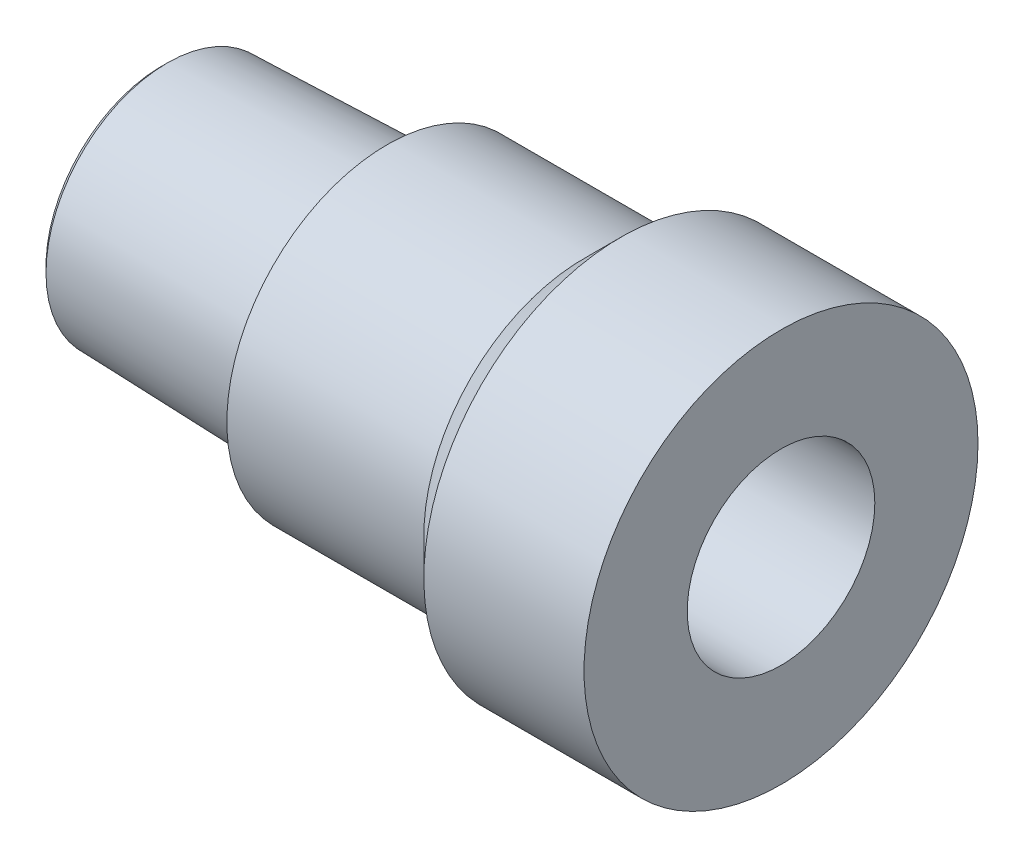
ISO-10303-21;
HEADER;
FILE_DESCRIPTION(('STEP AP214'),'2;1');
FILE_NAME('part.step','',(''),(''),'','','');
FILE_SCHEMA(('AUTOMOTIVE_DESIGN { 1 0 10303 214 1 1 1 1 }'));
ENDSEC;
DATA;
#1=APPLICATION_CONTEXT('core data for automotive mechanical design processes');
#2=APPLICATION_PROTOCOL_DEFINITION('international standard','automotive_design',2000,#1);
#3=PRODUCT_CONTEXT('',#1,'mechanical');
#4=PRODUCT('Part','Part','',(#3));
#5=PRODUCT_RELATED_PRODUCT_CATEGORY('part','',(#4));
#6=PRODUCT_DEFINITION_FORMATION('','',#4);
#7=PRODUCT_DEFINITION_CONTEXT('part definition',#1,'design');
#8=PRODUCT_DEFINITION('design','',#6,#7);
#9=PRODUCT_DEFINITION_SHAPE('','',#8);
#10=(LENGTH_UNIT() NAMED_UNIT(*) SI_UNIT(.MILLI.,.METRE.));
#11=(NAMED_UNIT(*) PLANE_ANGLE_UNIT() SI_UNIT($,.RADIAN.));
#12=(NAMED_UNIT(*) SI_UNIT($,.STERADIAN.) SOLID_ANGLE_UNIT());
#13=UNCERTAINTY_MEASURE_WITH_UNIT(LENGTH_MEASURE(1.E-05),#10,'distance_accuracy_value','');
#14=(GEOMETRIC_REPRESENTATION_CONTEXT(3) GLOBAL_UNCERTAINTY_ASSIGNED_CONTEXT((#13)) GLOBAL_UNIT_ASSIGNED_CONTEXT((#10,
#11,#12)) REPRESENTATION_CONTEXT('',''));
#15=CARTESIAN_POINT('',(0.,0.,0.));
#16=DIRECTION('',(0.,0.,1.));
#17=DIRECTION('',(1.,0.,0.));
#18=AXIS2_PLACEMENT_3D('',#15,#16,#17);
#19=CARTESIAN_POINT('',(93.,52.711266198,120.988));
#20=DIRECTION('',(1.,0.,0.));
#21=DIRECTION('',(0.,0.866025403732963,-0.500000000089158));
#22=AXIS2_PLACEMENT_3D('',#19,#20,#21);
#23=PLANE('',#22);
#24=DIRECTION('',(0.,0.500000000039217,0.866025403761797));
#25=VECTOR('',#24,1.);
#26=CARTESIAN_POINT('',(93.,54.4641016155,120.));
#27=LINE('',#26,#25);
#28=CARTESIAN_POINT('',(93.,54.4641016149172,119.999999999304));
#29=VERTEX_POINT('',#28);
#30=CARTESIAN_POINT('',(93.,55.6188021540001,122.));
#31=VERTEX_POINT('',#30);
#32=EDGE_CURVE('E146',#29,#31,#27,.T.);
#33=ORIENTED_EDGE('',*,*,#32,.T.);
#34=DIRECTION('',(0.,-0.500000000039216,0.866025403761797));
#35=VECTOR('',#34,1.);
#36=CARTESIAN_POINT('',(93.,54.4641016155,124.));
#37=LINE('',#36,#35);
#38=CARTESIAN_POINT('',(93.,54.464101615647,123.999999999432));
#39=VERTEX_POINT('',#38);
#40=EDGE_CURVE('E128',#31,#39,#37,.T.);
#41=ORIENTED_EDGE('',*,*,#40,.T.);
#42=CARTESIAN_POINT('',(93.,51.,122.));
#43=DIRECTION('',(-1.,0.,0.));
#44=DIRECTION('',(0.,0.,1.));
#45=AXIS2_PLACEMENT_3D('',#42,#43,#44);
#46=CIRCLE('',#45,4.);
#47=EDGE_CURVE('E88',#29,#39,#46,.F.);
#48=ORIENTED_EDGE('',*,*,#47,.F.);
#49=EDGE_LOOP('',(#33,#41,#48));
#50=FACE_BOUND('',#49,.T.);
#51=ADVANCED_FACE('F16',(#50),#23,.T.);
#52=CARTESIAN_POINT('',(93.,50.975751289,126.006));
#53=DIRECTION('',(1.,0.,0.));
#54=DIRECTION('',(0.,0.866025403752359,-0.500000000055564));
#55=AXIS2_PLACEMENT_3D('',#52,#53,#54);
#56=PLANE('',#55);
#57=DIRECTION('',(0.,-0.500000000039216,0.866025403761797));
#58=VECTOR('',#57,1.);
#59=CARTESIAN_POINT('',(93.,54.4641016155,124.));
#60=LINE('',#59,#58);
#61=CARTESIAN_POINT('',(93.,53.3094010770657,126.));
#62=VERTEX_POINT('',#61);
#63=EDGE_CURVE('E137',#39,#62,#60,.T.);
#64=ORIENTED_EDGE('',*,*,#63,.T.);
#65=DIRECTION('',(0.,-1.,0.));
#66=VECTOR('',#65,1.);
#67=CARTESIAN_POINT('',(93.,51.,126.));
#68=LINE('',#67,#66);
#69=CARTESIAN_POINT('',(93.,50.9999999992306,126.));
#70=VERTEX_POINT('',#69);
#71=EDGE_CURVE('E119',#62,#70,#68,.T.);
#72=ORIENTED_EDGE('',*,*,#71,.T.);
#73=CARTESIAN_POINT('',(93.,51.,122.));
#74=DIRECTION('',(-1.,0.,0.));
#75=DIRECTION('',(0.,0.,1.));
#76=AXIS2_PLACEMENT_3D('',#73,#74,#75);
#77=CIRCLE('',#76,4.);
#78=EDGE_CURVE('E178',#39,#70,#77,.F.);
#79=ORIENTED_EDGE('',*,*,#78,.F.);
#80=EDGE_LOOP('',(#64,#72,#79));
#81=FACE_BOUND('',#80,.T.);
#82=ADVANCED_FACE('F250',(#81),#56,.T.);
#83=CARTESIAN_POINT('',(93.,47.52550608,123.982));
#84=DIRECTION('',(1.,0.,0.));
#85=DIRECTION('',(0.,0.866025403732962,-0.50000000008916));
#86=AXIS2_PLACEMENT_3D('',#83,#84,#85);
#87=PLANE('',#86);
#88=DIRECTION('',(0.,-1.,0.));
#89=VECTOR('',#88,1.);
#90=CARTESIAN_POINT('',(93.,51.,126.));
#91=LINE('',#90,#89);
#92=CARTESIAN_POINT('',(93.,48.6905989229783,125.999999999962));
#93=VERTEX_POINT('',#92);
#94=EDGE_CURVE('E124',#70,#93,#91,.T.);
#95=ORIENTED_EDGE('',*,*,#94,.T.);
#96=DIRECTION('',(0.,-0.500000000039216,-0.866025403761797));
#97=VECTOR('',#96,1.);
#98=CARTESIAN_POINT('',(93.,47.5358983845,124.));
#99=LINE('',#98,#97);
#100=CARTESIAN_POINT('',(93.,47.5358983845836,123.999999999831));
#101=VERTEX_POINT('',#100);
#102=EDGE_CURVE('E104',#93,#101,#99,.T.);
#103=ORIENTED_EDGE('',*,*,#102,.T.);
#104=CARTESIAN_POINT('',(93.,51.,122.));
#105=DIRECTION('',(-1.,0.,0.));
#106=DIRECTION('',(0.,0.,1.));
#107=AXIS2_PLACEMENT_3D('',#104,#105,#106);
#108=CIRCLE('',#107,4.);
#109=EDGE_CURVE('E83',#70,#101,#108,.F.);
#110=ORIENTED_EDGE('',*,*,#109,.F.);
#111=EDGE_LOOP('',(#95,#103,#110));
#112=FACE_BOUND('',#111,.T.);
#113=ADVANCED_FACE('F253',(#112),#87,.T.);
#114=CARTESIAN_POINT('',(93.,47.542826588,124.024));
#115=DIRECTION('',(1.,0.,0.));
#116=DIRECTION('',(0.,-1.,0.));
#117=AXIS2_PLACEMENT_3D('',#114,#115,#116);
#118=PLANE('',#117);
#119=DIRECTION('',(0.,-0.500000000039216,-0.866025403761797));
#120=VECTOR('',#119,1.);
#121=CARTESIAN_POINT('',(93.,47.5358983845,124.));
#122=LINE('',#121,#120);
#123=CARTESIAN_POINT('',(93.,46.3811978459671,122.000000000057));
#124=VERTEX_POINT('',#123);
#125=EDGE_CURVE('E107',#101,#124,#122,.T.);
#126=ORIENTED_EDGE('',*,*,#125,.T.);
#127=DIRECTION('',(0.,0.500000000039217,-0.866025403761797));
#128=VECTOR('',#127,1.);
#129=CARTESIAN_POINT('',(93.,47.5358983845,120.));
#130=LINE('',#129,#128);
#131=CARTESIAN_POINT('',(93.,47.5358983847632,119.999999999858));
#132=VERTEX_POINT('',#131);
#133=EDGE_CURVE('E101',#124,#132,#130,.T.);
#134=ORIENTED_EDGE('',*,*,#133,.T.);
#135=CARTESIAN_POINT('',(93.,51.,122.));
#136=DIRECTION('',(-1.,0.,0.));
#137=DIRECTION('',(0.,0.,1.));
#138=AXIS2_PLACEMENT_3D('',#135,#136,#137);
#139=CIRCLE('',#138,4.);
#140=EDGE_CURVE('E79',#101,#132,#139,.F.);
#141=ORIENTED_EDGE('',*,*,#140,.F.);
#142=EDGE_LOOP('',(#126,#134,#141));
#143=FACE_BOUND('',#142,.T.);
#144=ADVANCED_FACE('F106',(#143),#118,.T.);
#145=CARTESIAN_POINT('',(93.,50.97921539,117.988));
#146=DIRECTION('',(1.,0.,0.));
#147=DIRECTION('',(0.,0.866025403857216,-0.499999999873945));
#148=AXIS2_PLACEMENT_3D('',#145,#146,#147);
#149=PLANE('',#148);
#150=DIRECTION('',(0.,1.,0.));
#151=VECTOR('',#150,1.);
#152=CARTESIAN_POINT('',(93.,51.,118.));
#153=LINE('',#152,#151);
#154=CARTESIAN_POINT('',(93.,50.9999999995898,118.));
#155=VERTEX_POINT('',#154);
#156=CARTESIAN_POINT('',(93.,53.3094010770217,118.000000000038));
#157=VERTEX_POINT('',#156);
#158=EDGE_CURVE('E109',#155,#157,#153,.T.);
#159=ORIENTED_EDGE('',*,*,#158,.T.);
#160=DIRECTION('',(0.,0.500000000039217,0.866025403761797));
#161=VECTOR('',#160,1.);
#162=CARTESIAN_POINT('',(93.,54.4641016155,120.));
#163=LINE('',#162,#161);
#164=EDGE_CURVE('E141',#157,#29,#163,.T.);
#165=ORIENTED_EDGE('',*,*,#164,.T.);
#166=CARTESIAN_POINT('',(93.,51.,122.));
#167=DIRECTION('',(-1.,0.,0.));
#168=DIRECTION('',(0.,0.,1.));
#169=AXIS2_PLACEMENT_3D('',#166,#167,#168);
#170=CIRCLE('',#169,4.);
#171=EDGE_CURVE('E73',#155,#29,#170,.F.);
#172=ORIENTED_EDGE('',*,*,#171,.F.);
#173=EDGE_LOOP('',(#159,#165,#172));
#174=FACE_BOUND('',#173,.T.);
#175=ADVANCED_FACE('F190',(#174),#149,.T.);
#176=CARTESIAN_POINT('',(93.,51.02078461,120.012));
#177=DIRECTION('',(1.,0.,0.));
#178=DIRECTION('',(0.,-1.,0.));
#179=AXIS2_PLACEMENT_3D('',#176,#177,#178);
#180=PLANE('',#179);
#181=DIRECTION('',(0.,0.500000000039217,-0.866025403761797));
#182=VECTOR('',#181,1.);
#183=CARTESIAN_POINT('',(93.,47.5358983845,120.));
#184=LINE('',#183,#182);
#185=CARTESIAN_POINT('',(93.,48.6905989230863,118.));
#186=VERTEX_POINT('',#185);
#187=EDGE_CURVE('E95',#132,#186,#184,.T.);
#188=ORIENTED_EDGE('',*,*,#187,.T.);
#189=DIRECTION('',(0.,1.,0.));
#190=VECTOR('',#189,1.);
#191=CARTESIAN_POINT('',(93.,51.,118.));
#192=LINE('',#191,#190);
#193=EDGE_CURVE('E97',#186,#155,#192,.T.);
#194=ORIENTED_EDGE('',*,*,#193,.T.);
#195=CARTESIAN_POINT('',(93.,51.,122.));
#196=DIRECTION('',(-1.,0.,0.));
#197=DIRECTION('',(0.,0.,1.));
#198=AXIS2_PLACEMENT_3D('',#195,#196,#197);
#199=CIRCLE('',#198,4.);
#200=EDGE_CURVE('E20',#132,#155,#199,.F.);
#201=ORIENTED_EDGE('',*,*,#200,.F.);
#202=EDGE_LOOP('',(#188,#194,#201));
#203=FACE_BOUND('',#202,.T.);
#204=ADVANCED_FACE('F94',(#203),#180,.T.);
#205=CARTESIAN_POINT('',(93.,51.,122.));
#206=DIRECTION('',(-1.,0.,0.));
#207=DIRECTION('',(0.,0.,1.));
#208=AXIS2_PLACEMENT_3D('',#205,#206,#207);
#209=CYLINDRICAL_SURFACE('',#208,4.);
#210=CARTESIAN_POINT('',(89.,51.,122.));
#211=DIRECTION('',(-1.,0.,0.));
#212=DIRECTION('',(0.,0.,1.));
#213=AXIS2_PLACEMENT_3D('',#210,#211,#212);
#214=CIRCLE('',#213,4.);
#215=CARTESIAN_POINT('',(89.,51.,126.));
#216=VERTEX_POINT('',#215);
#217=EDGE_CURVE('E174',#216,#216,#214,.F.);
#218=ORIENTED_EDGE('',*,*,#217,.F.);
#219=EDGE_LOOP('',(#218));
#220=FACE_BOUND('',#219,.T.);
#221=ORIENTED_EDGE('',*,*,#78,.T.);
#222=ORIENTED_EDGE('',*,*,#109,.T.);
#223=ORIENTED_EDGE('',*,*,#140,.T.);
#224=ORIENTED_EDGE('',*,*,#200,.T.);
#225=ORIENTED_EDGE('',*,*,#171,.T.);
#226=ORIENTED_EDGE('',*,*,#47,.T.);
#227=EDGE_LOOP('',(#221,#222,#223,#224,#225,#226));
#228=FACE_BOUND('',#227,.T.);
#229=ADVANCED_FACE('F82',(#220,#228),#209,.F.);
#230=CARTESIAN_POINT('',(101.,55.618802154,122.));
#231=DIRECTION('',(0.,0.866025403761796,-0.500000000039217));
#232=DIRECTION('',(0.,-0.500000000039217,-0.866025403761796));
#233=AXIS2_PLACEMENT_3D('',#230,#231,#232);
#234=PLANE('',#233);
#235=DIRECTION('',(1.,0.,0.));
#236=VECTOR('',#235,1.);
#237=CARTESIAN_POINT('',(97.,53.309401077,118.));
#238=LINE('',#237,#236);
#239=CARTESIAN_POINT('',(101.,53.3094010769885,117.99999999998));
#240=VERTEX_POINT('',#239);
#241=EDGE_CURVE('E111',#157,#240,#238,.T.);
#242=ORIENTED_EDGE('',*,*,#241,.T.);
#243=DIRECTION('',(0.,-0.500000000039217,-0.866025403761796));
#244=VECTOR('',#243,1.);
#245=CARTESIAN_POINT('',(101.,55.618802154,122.));
#246=LINE('',#245,#244);
#247=CARTESIAN_POINT('',(101.,55.618802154,122.));
#248=VERTEX_POINT('',#247);
#249=EDGE_CURVE('E172',#240,#248,#246,.F.);
#250=ORIENTED_EDGE('',*,*,#249,.T.);
#251=DIRECTION('',(-1.,0.,0.));
#252=VECTOR('',#251,1.);
#253=CARTESIAN_POINT('',(97.,55.618802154,122.));
#254=LINE('',#253,#252);
#255=EDGE_CURVE('E140',#248,#31,#254,.T.);
#256=ORIENTED_EDGE('',*,*,#255,.T.);
#257=ORIENTED_EDGE('',*,*,#32,.F.);
#258=ORIENTED_EDGE('',*,*,#164,.F.);
#259=EDGE_LOOP('',(#242,#250,#256,#257,#258));
#260=FACE_BOUND('',#259,.T.);
#261=ADVANCED_FACE('F186',(#260),#234,.F.);
#262=CARTESIAN_POINT('',(101.,53.309401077,126.));
#263=DIRECTION('',(0.,0.866025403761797,0.500000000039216));
#264=DIRECTION('',(0.,0.500000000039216,-0.866025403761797));
#265=AXIS2_PLACEMENT_3D('',#262,#263,#264);
#266=PLANE('',#265);
#267=ORIENTED_EDGE('',*,*,#255,.F.);
#268=DIRECTION('',(0.,0.500000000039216,-0.866025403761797));
#269=VECTOR('',#268,1.);
#270=CARTESIAN_POINT('',(101.,53.309401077,126.));
#271=LINE('',#270,#269);
#272=CARTESIAN_POINT('',(101.,53.3094010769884,126.00000000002));
#273=VERTEX_POINT('',#272);
#274=EDGE_CURVE('E132',#248,#273,#271,.F.);
#275=ORIENTED_EDGE('',*,*,#274,.T.);
#276=DIRECTION('',(-1.,0.,0.));
#277=VECTOR('',#276,1.);
#278=CARTESIAN_POINT('',(97.,53.309401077,126.));
#279=LINE('',#278,#277);
#280=EDGE_CURVE('E127',#273,#62,#279,.T.);
#281=ORIENTED_EDGE('',*,*,#280,.T.);
#282=ORIENTED_EDGE('',*,*,#63,.F.);
#283=ORIENTED_EDGE('',*,*,#40,.F.);
#284=EDGE_LOOP('',(#267,#275,#281,#282,#283));
#285=FACE_BOUND('',#284,.T.);
#286=ADVANCED_FACE('F266',(#285),#266,.F.);
#287=CARTESIAN_POINT('',(101.,48.690598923,126.));
#288=DIRECTION('',(0.,0.,1.));
#289=DIRECTION('',(0.,1.,0.));
#290=AXIS2_PLACEMENT_3D('',#287,#288,#289);
#291=PLANE('',#290);
#292=ORIENTED_EDGE('',*,*,#280,.F.);
#293=DIRECTION('',(0.,-1.,0.));
#294=VECTOR('',#293,1.);
#295=CARTESIAN_POINT('',(101.,51.,126.00000000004));
#296=LINE('',#295,#294);
#297=CARTESIAN_POINT('',(101.,48.6905989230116,126.00000000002));
#298=VERTEX_POINT('',#297);
#299=EDGE_CURVE('E129',#273,#298,#296,.T.);
#300=ORIENTED_EDGE('',*,*,#299,.T.);
#301=DIRECTION('',(-1.,0.,0.));
#302=VECTOR('',#301,1.);
#303=CARTESIAN_POINT('',(97.,48.690598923,126.));
#304=LINE('',#303,#302);
#305=EDGE_CURVE('E118',#298,#93,#304,.T.);
#306=ORIENTED_EDGE('',*,*,#305,.T.);
#307=ORIENTED_EDGE('',*,*,#94,.F.);
#308=ORIENTED_EDGE('',*,*,#71,.F.);
#309=EDGE_LOOP('',(#292,#300,#306,#307,#308));
#310=FACE_BOUND('',#309,.T.);
#311=ADVANCED_FACE('F269',(#310),#291,.F.);
#312=CARTESIAN_POINT('',(101.,46.381197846,122.));
#313=DIRECTION('',(0.,-0.866025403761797,0.500000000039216));
#314=DIRECTION('',(0.,0.500000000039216,0.866025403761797));
#315=AXIS2_PLACEMENT_3D('',#312,#313,#314);
#316=PLANE('',#315);
#317=ORIENTED_EDGE('',*,*,#305,.F.);
#318=DIRECTION('',(0.,0.500000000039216,0.866025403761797));
#319=VECTOR('',#318,1.);
#320=CARTESIAN_POINT('',(101.,46.381197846,122.));
#321=LINE('',#320,#319);
#322=CARTESIAN_POINT('',(101.,46.381197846,122.));
#323=VERTEX_POINT('',#322);
#324=EDGE_CURVE('E131',#298,#323,#321,.F.);
#325=ORIENTED_EDGE('',*,*,#324,.T.);
#326=DIRECTION('',(-1.,0.,0.));
#327=VECTOR('',#326,1.);
#328=CARTESIAN_POINT('',(97.,46.381197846,122.));
#329=LINE('',#328,#327);
#330=EDGE_CURVE('E103',#323,#124,#329,.T.);
#331=ORIENTED_EDGE('',*,*,#330,.T.);
#332=ORIENTED_EDGE('',*,*,#125,.F.);
#333=ORIENTED_EDGE('',*,*,#102,.F.);
#334=EDGE_LOOP('',(#317,#325,#331,#332,#333));
#335=FACE_BOUND('',#334,.T.);
#336=ADVANCED_FACE('F273',(#335),#316,.F.);
#337=CARTESIAN_POINT('',(101.,48.690598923,118.));
#338=DIRECTION('',(0.,-0.866025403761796,-0.500000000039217));
#339=DIRECTION('',(0.,-0.500000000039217,0.866025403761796));
#340=AXIS2_PLACEMENT_3D('',#337,#338,#339);
#341=PLANE('',#340);
#342=ORIENTED_EDGE('',*,*,#330,.F.);
#343=DIRECTION('',(0.,-0.500000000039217,0.866025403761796));
#344=VECTOR('',#343,1.);
#345=CARTESIAN_POINT('',(101.,48.690598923,118.));
#346=LINE('',#345,#344);
#347=CARTESIAN_POINT('',(101.,48.6905989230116,117.99999999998));
#348=VERTEX_POINT('',#347);
#349=EDGE_CURVE('E35',#323,#348,#346,.F.);
#350=ORIENTED_EDGE('',*,*,#349,.T.);
#351=DIRECTION('',(-1.,0.,0.));
#352=VECTOR('',#351,1.);
#353=CARTESIAN_POINT('',(97.,48.690598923,118.));
#354=LINE('',#353,#352);
#355=EDGE_CURVE('E102',#348,#186,#354,.T.);
#356=ORIENTED_EDGE('',*,*,#355,.T.);
#357=ORIENTED_EDGE('',*,*,#187,.F.);
#358=ORIENTED_EDGE('',*,*,#133,.F.);
#359=EDGE_LOOP('',(#342,#350,#356,#357,#358));
#360=FACE_BOUND('',#359,.T.);
#361=ADVANCED_FACE('F99',(#360),#341,.F.);
#362=CARTESIAN_POINT('',(101.,53.309401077,118.));
#363=DIRECTION('',(0.,0.,-1.));
#364=DIRECTION('',(0.,-1.,0.));
#365=AXIS2_PLACEMENT_3D('',#362,#363,#364);
#366=PLANE('',#365);
#367=ORIENTED_EDGE('',*,*,#355,.F.);
#368=DIRECTION('',(0.,1.,0.));
#369=VECTOR('',#368,1.);
#370=CARTESIAN_POINT('',(101.,51.,117.99999999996));
#371=LINE('',#370,#369);
#372=EDGE_CURVE('E168',#348,#240,#371,.T.);
#373=ORIENTED_EDGE('',*,*,#372,.T.);
#374=ORIENTED_EDGE('',*,*,#241,.F.);
#375=ORIENTED_EDGE('',*,*,#158,.F.);
#376=ORIENTED_EDGE('',*,*,#193,.F.);
#377=EDGE_LOOP('',(#367,#373,#374,#375,#376));
#378=FACE_BOUND('',#377,.T.);
#379=ADVANCED_FACE('F280',(#378),#366,.F.);
#380=CARTESIAN_POINT('',(89.,44.789054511,128.252652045));
#381=DIRECTION('',(-1.,0.,0.));
#382=DIRECTION('',(0.,1.,0.));
#383=AXIS2_PLACEMENT_3D('',#380,#381,#382);
#384=PLANE('',#383);
#385=ORIENTED_EDGE('',*,*,#217,.T.);
#386=EDGE_LOOP('',(#385));
#387=FACE_BOUND('',#386,.T.);
#388=CARTESIAN_POINT('',(89.,51.017396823,122.024309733));
#389=DIRECTION('',(1.,0.,0.));
#390=DIRECTION('',(0.,0.,-1.));
#391=AXIS2_PLACEMENT_3D('',#388,#389,#390);
#392=CIRCLE('',#391,6.15448845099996);
#393=CARTESIAN_POINT('',(89.,51.017396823,115.869821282));
#394=VERTEX_POINT('',#393);
#395=EDGE_CURVE('E165',#394,#394,#392,.F.);
#396=ORIENTED_EDGE('',*,*,#395,.T.);
#397=EDGE_LOOP('',(#396));
#398=FACE_BOUND('',#397,.T.);
#399=ADVANCED_FACE('F283',(#387,#398),#384,.T.);
#400=CARTESIAN_POINT('',(101.,45.94,116.94));
#401=DIRECTION('',(-1.,0.,0.));
#402=DIRECTION('',(0.,0.,1.));
#403=AXIS2_PLACEMENT_3D('',#400,#401,#402);
#404=PLANE('',#403);
#405=ORIENTED_EDGE('',*,*,#349,.F.);
#406=ORIENTED_EDGE('',*,*,#324,.F.);
#407=ORIENTED_EDGE('',*,*,#299,.F.);
#408=ORIENTED_EDGE('',*,*,#274,.F.);
#409=ORIENTED_EDGE('',*,*,#249,.F.);
#410=ORIENTED_EDGE('',*,*,#372,.F.);
#411=EDGE_LOOP('',(#405,#406,#407,#408,#409,#410));
#412=FACE_BOUND('',#411,.T.);
#413=CARTESIAN_POINT('',(101.,51.,122.));
#414=DIRECTION('',(1.,0.,0.));
#415=DIRECTION('',(0.,0.,-1.));
#416=AXIS2_PLACEMENT_3D('',#413,#414,#415);
#417=CIRCLE('',#416,5.);
#418=CARTESIAN_POINT('',(101.,51.,117.));
#419=VERTEX_POINT('',#418);
#420=EDGE_CURVE('E162',#419,#419,#417,.F.);
#421=ORIENTED_EDGE('',*,*,#420,.F.);
#422=EDGE_LOOP('',(#421));
#423=FACE_BOUND('',#422,.T.);
#424=ADVANCED_FACE('F243',(#412,#423),#404,.F.);
#425=CARTESIAN_POINT('',(89.,51.017396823,122.024309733));
#426=DIRECTION('',(1.,0.,0.));
#427=DIRECTION('',(0.,0.,-1.));
#428=AXIS2_PLACEMENT_3D('',#425,#426,#427);
#429=CONICAL_SURFACE('',#428,6.15448845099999,0.785398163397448);
#430=ORIENTED_EDGE('',*,*,#395,.F.);
#431=EDGE_LOOP('',(#430));
#432=FACE_BOUND('',#431,.T.);
#433=CARTESIAN_POINT('',(89.3090970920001,51.017396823,122.024309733));
#434=DIRECTION('',(1.,0.,0.));
#435=DIRECTION('',(0.,0.,-1.));
#436=AXIS2_PLACEMENT_3D('',#433,#434,#435);
#437=CIRCLE('',#436,6.46358554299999);
#438=CARTESIAN_POINT('',(89.309097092,51.017396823,115.56072419));
#439=VERTEX_POINT('',#438);
#440=EDGE_CURVE('E161',#439,#439,#437,.F.);
#441=ORIENTED_EDGE('',*,*,#440,.T.);
#442=EDGE_LOOP('',(#441));
#443=FACE_BOUND('',#442,.T.);
#444=ADVANCED_FACE('F236',(#432,#443),#429,.T.);
#445=CARTESIAN_POINT('',(101.,51.,122.));
#446=DIRECTION('',(1.,0.,0.));
#447=DIRECTION('',(0.,0.,-1.));
#448=AXIS2_PLACEMENT_3D('',#445,#446,#447);
#449=CYLINDRICAL_SURFACE('',#448,5.);
#450=CARTESIAN_POINT('',(122.,51.,122.));
#451=DIRECTION('',(1.,0.,0.));
#452=DIRECTION('',(0.,0.,-1.));
#453=AXIS2_PLACEMENT_3D('',#450,#451,#452);
#454=CIRCLE('',#453,5.);
#455=CARTESIAN_POINT('',(122.,51.,117.));
#456=VERTEX_POINT('',#455);
#457=EDGE_CURVE('E158',#456,#456,#454,.F.);
#458=ORIENTED_EDGE('',*,*,#457,.F.);
#459=EDGE_LOOP('',(#458));
#460=FACE_BOUND('',#459,.T.);
#461=ORIENTED_EDGE('',*,*,#420,.T.);
#462=EDGE_LOOP('',(#461));
#463=FACE_BOUND('',#462,.T.);
#464=ADVANCED_FACE('F230',(#460,#463),#449,.F.);
#465=CARTESIAN_POINT('',(89.309097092,51.017396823,122.024309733));
#466=DIRECTION('',(1.,0.,0.));
#467=DIRECTION('',(0.,0.,-1.));
#468=AXIS2_PLACEMENT_3D('',#465,#466,#467);
#469=CONICAL_SURFACE('',#468,6.46358554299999,0.0311244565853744);
#470=ORIENTED_EDGE('',*,*,#440,.F.);
#471=EDGE_LOOP('',(#470));
#472=FACE_BOUND('',#471,.T.);
#473=CARTESIAN_POINT('',(101.,51.017396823,122.024309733));
#474=DIRECTION('',(1.,0.,0.));
#475=DIRECTION('',(0.,0.,-1.));
#476=AXIS2_PLACEMENT_3D('',#473,#474,#475);
#477=CIRCLE('',#476,6.82757608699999);
#478=CARTESIAN_POINT('',(101.,51.017396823,115.196733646));
#479=VERTEX_POINT('',#478);
#480=EDGE_CURVE('E155',#479,#479,#477,.T.);
#481=ORIENTED_EDGE('',*,*,#480,.F.);
#482=EDGE_LOOP('',(#481));
#483=FACE_BOUND('',#482,.T.);
#484=ADVANCED_FACE('F225',(#472,#483),#469,.T.);
#485=CARTESIAN_POINT('',(122.,40.374,132.626));
#486=DIRECTION('',(1.,0.,0.));
#487=DIRECTION('',(0.,0.,-1.));
#488=AXIS2_PLACEMENT_3D('',#485,#486,#487);
#489=PLANE('',#488);
#490=ORIENTED_EDGE('',*,*,#457,.T.);
#491=EDGE_LOOP('',(#490));
#492=FACE_BOUND('',#491,.T.);
#493=CARTESIAN_POINT('',(122.,51.,122.));
#494=DIRECTION('',(1.,0.,0.));
#495=DIRECTION('',(0.,0.,-1.));
#496=AXIS2_PLACEMENT_3D('',#493,#494,#495);
#497=CIRCLE('',#496,10.5);
#498=CARTESIAN_POINT('',(122.,51.,111.5));
#499=VERTEX_POINT('',#498);
#500=EDGE_CURVE('E152',#499,#499,#497,.T.);
#501=ORIENTED_EDGE('',*,*,#500,.T.);
#502=EDGE_LOOP('',(#501));
#503=FACE_BOUND('',#502,.T.);
#504=ADVANCED_FACE('F216',(#492,#503),#489,.T.);
#505=CARTESIAN_POINT('',(101.,42.358279,113.358279));
#506=DIRECTION('',(-1.,0.,0.));
#507=DIRECTION('',(0.,0.,1.));
#508=AXIS2_PLACEMENT_3D('',#505,#506,#507);
#509=PLANE('',#508);
#510=ORIENTED_EDGE('',*,*,#480,.T.);
#511=EDGE_LOOP('',(#510));
#512=FACE_BOUND('',#511,.T.);
#513=CARTESIAN_POINT('',(101.,51.,122.));
#514=DIRECTION('',(1.,0.,0.));
#515=DIRECTION('',(0.,0.,-1.));
#516=AXIS2_PLACEMENT_3D('',#513,#514,#515);
#517=CIRCLE('',#516,8.53925);
#518=CARTESIAN_POINT('',(101.,51.,113.46075));
#519=VERTEX_POINT('',#518);
#520=EDGE_CURVE('E149',#519,#519,#517,.F.);
#521=ORIENTED_EDGE('',*,*,#520,.T.);
#522=EDGE_LOOP('',(#521));
#523=FACE_BOUND('',#522,.T.);
#524=ADVANCED_FACE('F18',(#512,#523),#509,.T.);
#525=CARTESIAN_POINT('',(113.46075,51.,122.));
#526=DIRECTION('',(1.,0.,0.));
#527=DIRECTION('',(0.,0.,-1.));
#528=AXIS2_PLACEMENT_3D('',#525,#526,#527);
#529=CYLINDRICAL_SURFACE('',#528,10.5);
#530=ORIENTED_EDGE('',*,*,#500,.F.);
#531=EDGE_LOOP('',(#530));
#532=FACE_BOUND('',#531,.T.);
#533=CARTESIAN_POINT('',(113.46075,51.,122.));
#534=DIRECTION('',(1.,0.,0.));
#535=DIRECTION('',(0.,-1.,0.));
#536=AXIS2_PLACEMENT_3D('',#533,#534,#535);
#537=CIRCLE('',#536,10.5);
#538=CARTESIAN_POINT('',(113.46075,40.5,122.));
#539=VERTEX_POINT('',#538);
#540=EDGE_CURVE('E26',#539,#539,#537,.T.);
#541=ORIENTED_EDGE('',*,*,#540,.T.);
#542=EDGE_LOOP('',(#541));
#543=FACE_BOUND('',#542,.T.);
#544=ADVANCED_FACE('F201',(#532,#543),#529,.T.);
#545=CARTESIAN_POINT('',(101.,51.,122.));
#546=DIRECTION('',(1.,0.,0.));
#547=DIRECTION('',(0.,0.,-1.));
#548=AXIS2_PLACEMENT_3D('',#545,#546,#547);
#549=CYLINDRICAL_SURFACE('',#548,8.53925);
#550=CARTESIAN_POINT('',(111.5,51.,122.));
#551=DIRECTION('',(1.,0.,0.));
#552=DIRECTION('',(0.,-1.,0.));
#553=AXIS2_PLACEMENT_3D('',#550,#551,#552);
#554=CIRCLE('',#553,8.53925);
#555=CARTESIAN_POINT('',(111.5,42.46075,122.));
#556=VERTEX_POINT('',#555);
#557=EDGE_CURVE('E11',#556,#556,#554,.F.);
#558=ORIENTED_EDGE('',*,*,#557,.T.);
#559=EDGE_LOOP('',(#558));
#560=FACE_BOUND('',#559,.T.);
#561=ORIENTED_EDGE('',*,*,#520,.F.);
#562=EDGE_LOOP('',(#561));
#563=FACE_BOUND('',#562,.T.);
#564=ADVANCED_FACE('F206',(#560,#563),#549,.T.);
#565=CARTESIAN_POINT('',(111.5,51.,122.));
#566=DIRECTION('',(1.,0.,0.));
#567=DIRECTION('',(0.,0.,-1.));
#568=AXIS2_PLACEMENT_3D('',#565,#566,#567);
#569=CONICAL_SURFACE('',#568,8.53925,0.785398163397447);
#570=ORIENTED_EDGE('',*,*,#540,.F.);
#571=EDGE_LOOP('',(#570));
#572=FACE_BOUND('',#571,.T.);
#573=ORIENTED_EDGE('',*,*,#557,.F.);
#574=EDGE_LOOP('',(#573));
#575=FACE_BOUND('',#574,.T.);
#576=ADVANCED_FACE('F203',(#572,#575),#569,.T.);
#577=CLOSED_SHELL('',(#51,#82,#113,#144,#175,#204,#229,#261,#286,#311,#336,#361,#379,#399,#424,
#444,#464,#484,#504,#524,#544,#564,#576));
#578=MANIFOLD_SOLID_BREP('B1',#577);
#579=ADVANCED_BREP_SHAPE_REPRESENTATION('',(#18,#578),#14);
#580=SHAPE_DEFINITION_REPRESENTATION(#9,#579);
ENDSEC;
END-ISO-10303-21;
